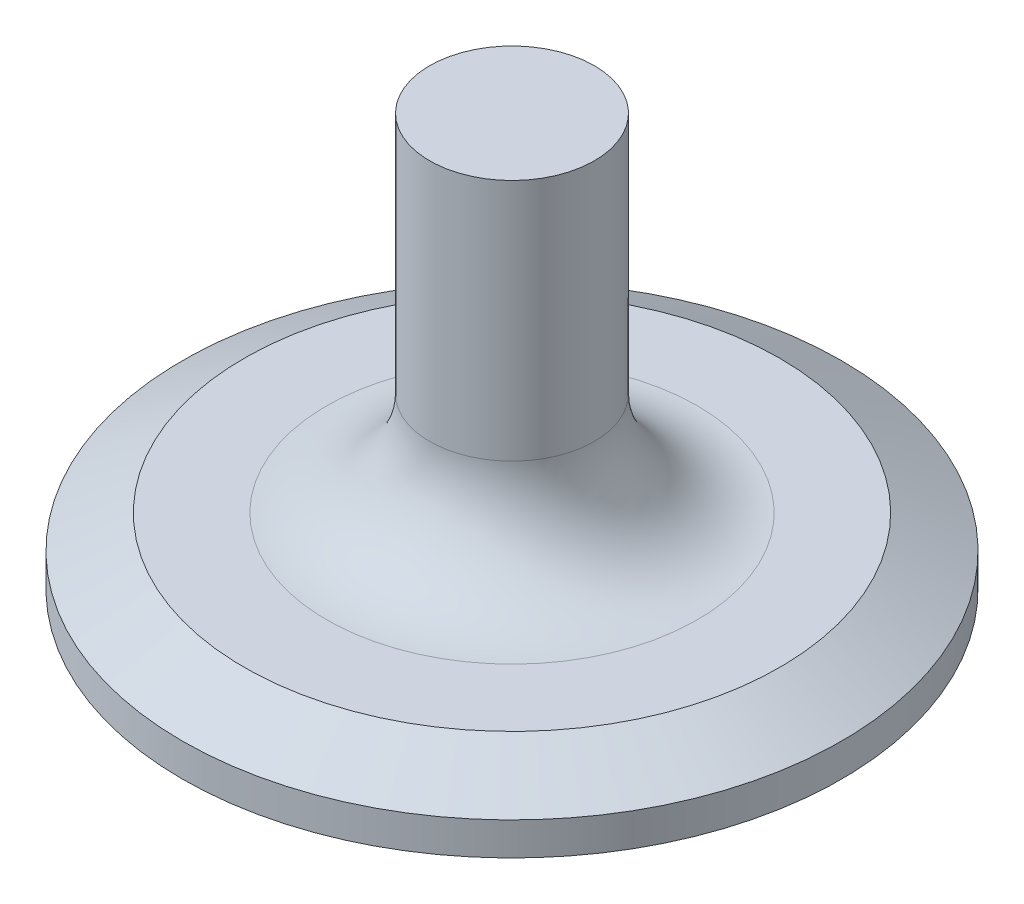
from build123d import *


with BuildPart() as part:
    # Sketch1 → Revolve1 (revolve)
    with BuildSketch(Plane.XY, mode=Mode.PRIVATE) as revolve1_sk:
        with BuildLine():
            Line((0, 0), (-80, 0))
            Line((-80, 0), (-80, 8))
            Line((-80, 8), (-65, 16))
            Line((-65, 16), (-45, 16))
            ThreePointArc((-45, 16), (-27.32233047, 23.32233047), (-20, 41))
            Line((-20, 41), (-20, 100))
            Line((-20, 100), (0, 100))
            Line((0, 100), (0, 0))
        make_face()
    revolve(revolve1_sk.sketch.rotate(Axis((0, -70.251436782, 0), (0, 1, 0)), 270), axis=Axis((0, -70.251436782, 0), (0, 1, 0)))


solid = part.part
